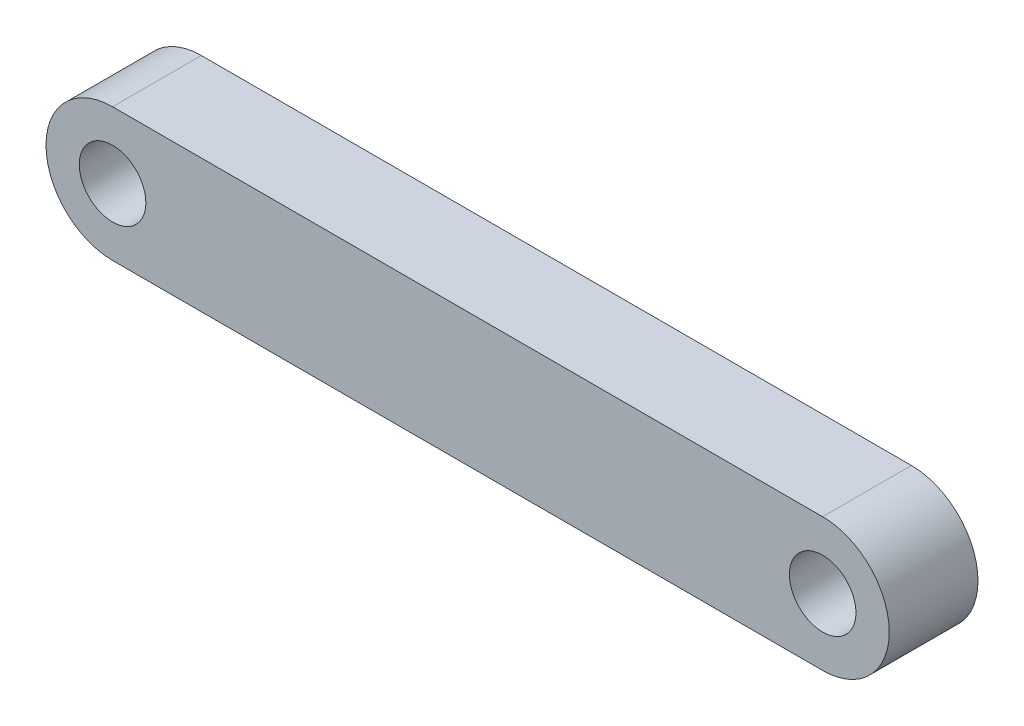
ISO-10303-21;
HEADER;
FILE_DESCRIPTION(('STEP AP214'),'2;1');
FILE_NAME('part.step','',(''),(''),'','','');
FILE_SCHEMA(('AUTOMOTIVE_DESIGN { 1 0 10303 214 1 1 1 1 }'));
ENDSEC;
DATA;
#1=APPLICATION_CONTEXT('core data for automotive mechanical design processes');
#2=APPLICATION_PROTOCOL_DEFINITION('international standard','automotive_design',2000,#1);
#3=PRODUCT_CONTEXT('',#1,'mechanical');
#4=PRODUCT('Part','Part','',(#3));
#5=PRODUCT_RELATED_PRODUCT_CATEGORY('part','',(#4));
#6=PRODUCT_DEFINITION_FORMATION('','',#4);
#7=PRODUCT_DEFINITION_CONTEXT('part definition',#1,'design');
#8=PRODUCT_DEFINITION('design','',#6,#7);
#9=PRODUCT_DEFINITION_SHAPE('','',#8);
#10=(LENGTH_UNIT() NAMED_UNIT(*) SI_UNIT(.MILLI.,.METRE.));
#11=(NAMED_UNIT(*) PLANE_ANGLE_UNIT() SI_UNIT($,.RADIAN.));
#12=(NAMED_UNIT(*) SI_UNIT($,.STERADIAN.) SOLID_ANGLE_UNIT());
#13=UNCERTAINTY_MEASURE_WITH_UNIT(LENGTH_MEASURE(1.E-05),#10,'distance_accuracy_value','');
#14=(GEOMETRIC_REPRESENTATION_CONTEXT(3) GLOBAL_UNCERTAINTY_ASSIGNED_CONTEXT((#13)) GLOBAL_UNIT_ASSIGNED_CONTEXT((#10,
#11,#12)) REPRESENTATION_CONTEXT('',''));
#15=CARTESIAN_POINT('',(0.,0.,0.));
#16=DIRECTION('',(0.,0.,1.));
#17=DIRECTION('',(1.,0.,0.));
#18=AXIS2_PLACEMENT_3D('',#15,#16,#17);
#19=CARTESIAN_POINT('',(0.,0.,12.7));
#20=DIRECTION('',(0.,0.,1.));
#21=DIRECTION('',(1.,0.,0.));
#22=AXIS2_PLACEMENT_3D('',#19,#20,#21);
#23=PLANE('',#22);
#24=CARTESIAN_POINT('',(203.2,0.,12.7));
#25=DIRECTION('',(0.,0.,1.));
#26=DIRECTION('',(1.,0.,0.));
#27=AXIS2_PLACEMENT_3D('',#24,#25,#26);
#28=CIRCLE('',#27,9.52500000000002);
#29=CARTESIAN_POINT('',(212.725,0.,12.7));
#30=VERTEX_POINT('',#29);
#31=EDGE_CURVE('E97',#30,#30,#28,.T.);
#32=ORIENTED_EDGE('',*,*,#31,.F.);
#33=EDGE_LOOP('',(#32));
#34=FACE_BOUND('',#33,.T.);
#35=CARTESIAN_POINT('',(0.,0.,12.7));
#36=DIRECTION('',(0.,0.,1.));
#37=DIRECTION('',(1.,0.,0.));
#38=AXIS2_PLACEMENT_3D('',#35,#36,#37);
#39=CIRCLE('',#38,19.05);
#40=CARTESIAN_POINT('',(0.,19.05,12.7));
#41=VERTEX_POINT('',#40);
#42=CARTESIAN_POINT('',(0.,-19.05,12.7));
#43=VERTEX_POINT('',#42);
#44=EDGE_CURVE('E72',#41,#43,#39,.T.);
#45=ORIENTED_EDGE('',*,*,#44,.T.);
#46=DIRECTION('',(-1.,0.,0.));
#47=VECTOR('',#46,1.);
#48=CARTESIAN_POINT('',(203.2,-19.05,12.7));
#49=LINE('',#48,#47);
#50=CARTESIAN_POINT('',(203.2,-19.05,12.7));
#51=VERTEX_POINT('',#50);
#52=EDGE_CURVE('E79',#51,#43,#49,.T.);
#53=ORIENTED_EDGE('',*,*,#52,.F.);
#54=CARTESIAN_POINT('',(203.2,0.,12.7));
#55=DIRECTION('',(0.,0.,-1.));
#56=DIRECTION('',(-1.,0.,0.));
#57=AXIS2_PLACEMENT_3D('',#54,#55,#56);
#58=CIRCLE('',#57,19.05);
#59=CARTESIAN_POINT('',(203.2,19.05,12.7));
#60=VERTEX_POINT('',#59);
#61=EDGE_CURVE('E87',#60,#51,#58,.T.);
#62=ORIENTED_EDGE('',*,*,#61,.F.);
#63=DIRECTION('',(1.,0.,0.));
#64=VECTOR('',#63,1.);
#65=CARTESIAN_POINT('',(0.,19.05,12.7));
#66=LINE('',#65,#64);
#67=EDGE_CURVE('E90',#41,#60,#66,.T.);
#68=ORIENTED_EDGE('',*,*,#67,.F.);
#69=EDGE_LOOP('',(#45,#53,#62,#68));
#70=FACE_BOUND('',#69,.T.);
#71=CARTESIAN_POINT('',(0.,0.,12.7));
#72=DIRECTION('',(0.,0.,1.));
#73=DIRECTION('',(1.,0.,0.));
#74=AXIS2_PLACEMENT_3D('',#71,#72,#73);
#75=CIRCLE('',#74,9.525);
#76=CARTESIAN_POINT('',(9.525,0.,12.7));
#77=VERTEX_POINT('',#76);
#78=EDGE_CURVE('E110',#77,#77,#75,.T.);
#79=ORIENTED_EDGE('',*,*,#78,.F.);
#80=EDGE_LOOP('',(#79));
#81=FACE_BOUND('',#80,.T.);
#82=ADVANCED_FACE('F31',(#34,#70,#81),#23,.T.);
#83=CARTESIAN_POINT('',(0.,0.,-12.7));
#84=DIRECTION('',(0.,0.,1.));
#85=DIRECTION('',(1.,0.,0.));
#86=AXIS2_PLACEMENT_3D('',#83,#84,#85);
#87=PLANE('',#86);
#88=CARTESIAN_POINT('',(203.2,0.,-12.7));
#89=DIRECTION('',(0.,0.,1.));
#90=DIRECTION('',(1.,0.,0.));
#91=AXIS2_PLACEMENT_3D('',#88,#89,#90);
#92=CIRCLE('',#91,9.52500000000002);
#93=CARTESIAN_POINT('',(212.725,0.,-12.7));
#94=VERTEX_POINT('',#93);
#95=EDGE_CURVE('E107',#94,#94,#92,.T.);
#96=ORIENTED_EDGE('',*,*,#95,.T.);
#97=EDGE_LOOP('',(#96));
#98=FACE_BOUND('',#97,.T.);
#99=CARTESIAN_POINT('',(0.,0.,-12.7));
#100=DIRECTION('',(0.,0.,1.));
#101=DIRECTION('',(1.,0.,0.));
#102=AXIS2_PLACEMENT_3D('',#99,#100,#101);
#103=CIRCLE('',#102,19.05);
#104=CARTESIAN_POINT('',(0.,19.05,-12.7));
#105=VERTEX_POINT('',#104);
#106=CARTESIAN_POINT('',(0.,-19.05,-12.7));
#107=VERTEX_POINT('',#106);
#108=EDGE_CURVE('E95',#105,#107,#103,.T.);
#109=ORIENTED_EDGE('',*,*,#108,.F.);
#110=DIRECTION('',(1.,0.,0.));
#111=VECTOR('',#110,1.);
#112=CARTESIAN_POINT('',(0.,19.05,-12.7));
#113=LINE('',#112,#111);
#114=CARTESIAN_POINT('',(203.2,19.05,-12.7));
#115=VERTEX_POINT('',#114);
#116=EDGE_CURVE('E101',#105,#115,#113,.T.);
#117=ORIENTED_EDGE('',*,*,#116,.T.);
#118=CARTESIAN_POINT('',(203.2,0.,-12.7));
#119=DIRECTION('',(0.,0.,-1.));
#120=DIRECTION('',(-1.,0.,0.));
#121=AXIS2_PLACEMENT_3D('',#118,#119,#120);
#122=CIRCLE('',#121,19.05);
#123=CARTESIAN_POINT('',(203.2,-19.05,-12.7));
#124=VERTEX_POINT('',#123);
#125=EDGE_CURVE('E99',#115,#124,#122,.T.);
#126=ORIENTED_EDGE('',*,*,#125,.T.);
#127=DIRECTION('',(-1.,0.,0.));
#128=VECTOR('',#127,1.);
#129=CARTESIAN_POINT('',(203.2,-19.05,-12.7));
#130=LINE('',#129,#128);
#131=EDGE_CURVE('E81',#124,#107,#130,.T.);
#132=ORIENTED_EDGE('',*,*,#131,.T.);
#133=EDGE_LOOP('',(#109,#117,#126,#132));
#134=FACE_BOUND('',#133,.T.);
#135=CARTESIAN_POINT('',(0.,0.,-12.7));
#136=DIRECTION('',(0.,0.,1.));
#137=DIRECTION('',(1.,0.,0.));
#138=AXIS2_PLACEMENT_3D('',#135,#136,#137);
#139=CIRCLE('',#138,9.525);
#140=CARTESIAN_POINT('',(9.525,0.,-12.7));
#141=VERTEX_POINT('',#140);
#142=EDGE_CURVE('E113',#141,#141,#139,.T.);
#143=ORIENTED_EDGE('',*,*,#142,.T.);
#144=EDGE_LOOP('',(#143));
#145=FACE_BOUND('',#144,.T.);
#146=ADVANCED_FACE('F122',(#98,#134,#145),#87,.F.);
#147=CARTESIAN_POINT('',(0.,0.,12.7));
#148=DIRECTION('',(0.,0.,-1.));
#149=DIRECTION('',(-1.,0.,0.));
#150=AXIS2_PLACEMENT_3D('',#147,#148,#149);
#151=CYLINDRICAL_SURFACE('',#150,19.05);
#152=ORIENTED_EDGE('',*,*,#108,.T.);
#153=DIRECTION('',(0.,0.,-1.));
#154=VECTOR('',#153,1.);
#155=CARTESIAN_POINT('',(0.,-19.05,12.7));
#156=LINE('',#155,#154);
#157=EDGE_CURVE('E11',#43,#107,#156,.T.);
#158=ORIENTED_EDGE('',*,*,#157,.F.);
#159=ORIENTED_EDGE('',*,*,#44,.F.);
#160=DIRECTION('',(0.,0.,-1.));
#161=VECTOR('',#160,1.);
#162=CARTESIAN_POINT('',(0.,19.05,12.7));
#163=LINE('',#162,#161);
#164=EDGE_CURVE('E48',#41,#105,#163,.T.);
#165=ORIENTED_EDGE('',*,*,#164,.T.);
#166=EDGE_LOOP('',(#152,#158,#159,#165));
#167=FACE_BOUND('',#166,.T.);
#168=ADVANCED_FACE('F33',(#167),#151,.T.);
#169=CARTESIAN_POINT('',(203.2,-19.05,12.7));
#170=DIRECTION('',(0.,-1.,0.));
#171=DIRECTION('',(1.,0.,0.));
#172=AXIS2_PLACEMENT_3D('',#169,#170,#171);
#173=PLANE('',#172);
#174=ORIENTED_EDGE('',*,*,#131,.F.);
#175=DIRECTION('',(0.,0.,-1.));
#176=VECTOR('',#175,1.);
#177=CARTESIAN_POINT('',(203.2,-19.05,12.7));
#178=LINE('',#177,#176);
#179=EDGE_CURVE('E40',#51,#124,#178,.T.);
#180=ORIENTED_EDGE('',*,*,#179,.F.);
#181=ORIENTED_EDGE('',*,*,#52,.T.);
#182=ORIENTED_EDGE('',*,*,#157,.T.);
#183=EDGE_LOOP('',(#174,#180,#181,#182));
#184=FACE_BOUND('',#183,.T.);
#185=ADVANCED_FACE('F78',(#184),#173,.T.);
#186=CARTESIAN_POINT('',(203.2,0.,12.7));
#187=DIRECTION('',(0.,0.,-1.));
#188=DIRECTION('',(-1.,0.,0.));
#189=AXIS2_PLACEMENT_3D('',#186,#187,#188);
#190=CYLINDRICAL_SURFACE('',#189,19.05);
#191=ORIENTED_EDGE('',*,*,#125,.F.);
#192=DIRECTION('',(0.,0.,-1.));
#193=VECTOR('',#192,1.);
#194=CARTESIAN_POINT('',(203.2,19.05,12.7));
#195=LINE('',#194,#193);
#196=EDGE_CURVE('E61',#60,#115,#195,.T.);
#197=ORIENTED_EDGE('',*,*,#196,.F.);
#198=ORIENTED_EDGE('',*,*,#61,.T.);
#199=ORIENTED_EDGE('',*,*,#179,.T.);
#200=EDGE_LOOP('',(#191,#197,#198,#199));
#201=FACE_BOUND('',#200,.T.);
#202=ADVANCED_FACE('F89',(#201),#190,.T.);
#203=CARTESIAN_POINT('',(0.,19.05,12.7));
#204=DIRECTION('',(0.,1.,0.));
#205=DIRECTION('',(-1.,0.,0.));
#206=AXIS2_PLACEMENT_3D('',#203,#204,#205);
#207=PLANE('',#206);
#208=ORIENTED_EDGE('',*,*,#116,.F.);
#209=ORIENTED_EDGE('',*,*,#164,.F.);
#210=ORIENTED_EDGE('',*,*,#67,.T.);
#211=ORIENTED_EDGE('',*,*,#196,.T.);
#212=EDGE_LOOP('',(#208,#209,#210,#211));
#213=FACE_BOUND('',#212,.T.);
#214=ADVANCED_FACE('F135',(#213),#207,.T.);
#215=CARTESIAN_POINT('',(203.2,0.,12.7));
#216=DIRECTION('',(0.,0.,-1.));
#217=DIRECTION('',(-1.,0.,0.));
#218=AXIS2_PLACEMENT_3D('',#215,#216,#217);
#219=CYLINDRICAL_SURFACE('',#218,9.52500000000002);
#220=ORIENTED_EDGE('',*,*,#31,.T.);
#221=EDGE_LOOP('',(#220));
#222=FACE_BOUND('',#221,.T.);
#223=ORIENTED_EDGE('',*,*,#95,.F.);
#224=EDGE_LOOP('',(#223));
#225=FACE_BOUND('',#224,.T.);
#226=ADVANCED_FACE('F132',(#222,#225),#219,.F.);
#227=CARTESIAN_POINT('',(0.,0.,12.7));
#228=DIRECTION('',(0.,0.,-1.));
#229=DIRECTION('',(-1.,0.,0.));
#230=AXIS2_PLACEMENT_3D('',#227,#228,#229);
#231=CYLINDRICAL_SURFACE('',#230,9.525);
#232=ORIENTED_EDGE('',*,*,#78,.T.);
#233=EDGE_LOOP('',(#232));
#234=FACE_BOUND('',#233,.T.);
#235=ORIENTED_EDGE('',*,*,#142,.F.);
#236=EDGE_LOOP('',(#235));
#237=FACE_BOUND('',#236,.T.);
#238=ADVANCED_FACE('F119',(#234,#237),#231,.F.);
#239=CLOSED_SHELL('',(#82,#146,#168,#185,#202,#214,#226,#238));
#240=MANIFOLD_SOLID_BREP('B2',#239);
#241=ADVANCED_BREP_SHAPE_REPRESENTATION('',(#18,#240),#14);
#242=SHAPE_DEFINITION_REPRESENTATION(#9,#241);
ENDSEC;
END-ISO-10303-21;
